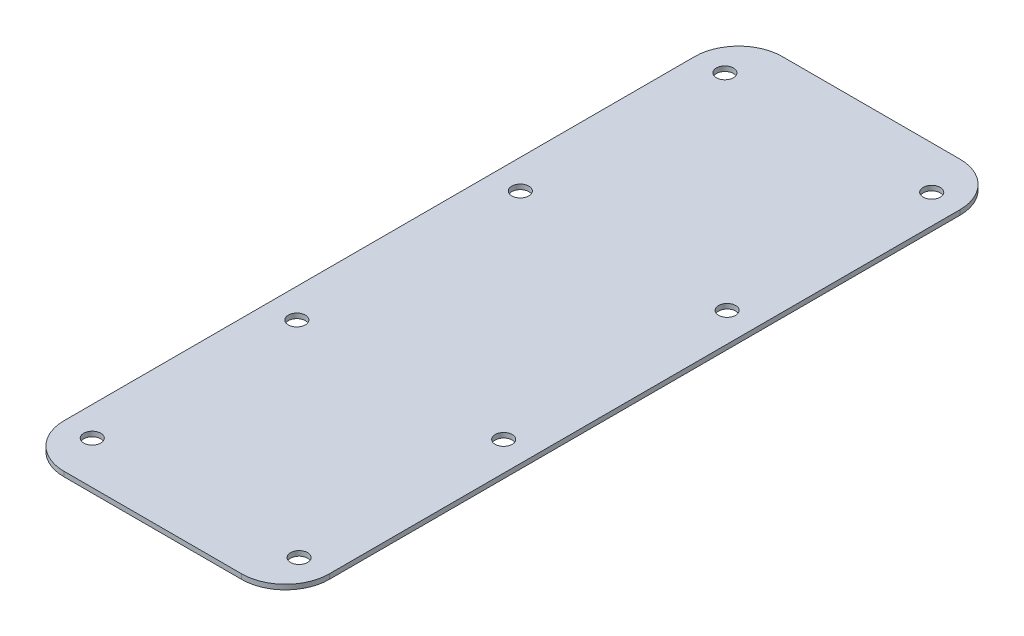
ISO-10303-21;
HEADER;
FILE_DESCRIPTION(('STEP AP214'),'2;1');
FILE_NAME('part.step','',(''),(''),'','','');
FILE_SCHEMA(('AUTOMOTIVE_DESIGN { 1 0 10303 214 1 1 1 1 }'));
ENDSEC;
DATA;
#1=APPLICATION_CONTEXT('core data for automotive mechanical design processes');
#2=APPLICATION_PROTOCOL_DEFINITION('international standard','automotive_design',2000,#1);
#3=PRODUCT_CONTEXT('',#1,'mechanical');
#4=PRODUCT('Part','Part','',(#3));
#5=PRODUCT_RELATED_PRODUCT_CATEGORY('part','',(#4));
#6=PRODUCT_DEFINITION_FORMATION('','',#4);
#7=PRODUCT_DEFINITION_CONTEXT('part definition',#1,'design');
#8=PRODUCT_DEFINITION('design','',#6,#7);
#9=PRODUCT_DEFINITION_SHAPE('','',#8);
#10=(LENGTH_UNIT() NAMED_UNIT(*) SI_UNIT(.MILLI.,.METRE.));
#11=(NAMED_UNIT(*) PLANE_ANGLE_UNIT() SI_UNIT($,.RADIAN.));
#12=(NAMED_UNIT(*) SI_UNIT($,.STERADIAN.) SOLID_ANGLE_UNIT());
#13=UNCERTAINTY_MEASURE_WITH_UNIT(LENGTH_MEASURE(1.E-05),#10,'distance_accuracy_value','');
#14=(GEOMETRIC_REPRESENTATION_CONTEXT(3) GLOBAL_UNCERTAINTY_ASSIGNED_CONTEXT((#13)) GLOBAL_UNIT_ASSIGNED_CONTEXT((#10,
#11,#12)) REPRESENTATION_CONTEXT('',''));
#15=CARTESIAN_POINT('',(0.,0.,0.));
#16=DIRECTION('',(0.,0.,1.));
#17=DIRECTION('',(1.,0.,0.));
#18=AXIS2_PLACEMENT_3D('',#15,#16,#17);
#19=CARTESIAN_POINT('',(0.,12.7,0.));
#20=DIRECTION('',(0.,1.,0.));
#21=DIRECTION('',(0.,0.,1.));
#22=AXIS2_PLACEMENT_3D('',#19,#20,#21);
#23=PLANE('',#22);
#24=CARTESIAN_POINT('',(-231.822207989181,12.7,264.461207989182));
#25=DIRECTION('',(0.,1.,0.));
#26=DIRECTION('',(0.,0.,1.));
#27=AXIS2_PLACEMENT_3D('',#24,#25,#26);
#28=CIRCLE('',#27,114.3);
#29=CARTESIAN_POINT('',(-346.122207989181,12.7,264.461207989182));
#30=VERTEX_POINT('',#29);
#31=CARTESIAN_POINT('',(-231.822207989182,12.7,378.761207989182));
#32=VERTEX_POINT('',#31);
#33=EDGE_CURVE('E50',#30,#32,#28,.T.);
#34=ORIENTED_EDGE('',*,*,#33,.T.);
#35=DIRECTION('',(1.,0.,0.));
#36=VECTOR('',#35,1.);
#37=CARTESIAN_POINT('',(-231.822207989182,12.7,378.761207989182));
#38=LINE('',#37,#36);
#39=CARTESIAN_POINT('',(231.822207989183,12.7,378.761207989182));
#40=VERTEX_POINT('',#39);
#41=EDGE_CURVE('E105',#32,#40,#38,.T.);
#42=ORIENTED_EDGE('',*,*,#41,.T.);
#43=CARTESIAN_POINT('',(231.822207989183,12.7,264.461207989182));
#44=DIRECTION('',(0.,1.,0.));
#45=DIRECTION('',(0.,0.,1.));
#46=AXIS2_PLACEMENT_3D('',#43,#44,#45);
#47=CIRCLE('',#46,114.3);
#48=CARTESIAN_POINT('',(346.122207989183,12.7,264.461207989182));
#49=VERTEX_POINT('',#48);
#50=EDGE_CURVE('E110',#40,#49,#47,.T.);
#51=ORIENTED_EDGE('',*,*,#50,.T.);
#52=DIRECTION('',(0.,0.,-1.));
#53=VECTOR('',#52,1.);
#54=CARTESIAN_POINT('',(346.122207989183,12.7,-1381.63787465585));
#55=LINE('',#54,#53);
#56=CARTESIAN_POINT('',(346.122207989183,12.7,-1381.63787465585));
#57=VERTEX_POINT('',#56);
#58=EDGE_CURVE('E126',#49,#57,#55,.T.);
#59=ORIENTED_EDGE('',*,*,#58,.T.);
#60=CARTESIAN_POINT('',(231.822207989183,12.7,-1381.63787465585));
#61=DIRECTION('',(0.,1.,0.));
#62=DIRECTION('',(0.,0.,-1.));
#63=AXIS2_PLACEMENT_3D('',#60,#61,#62);
#64=CIRCLE('',#63,114.3);
#65=CARTESIAN_POINT('',(231.822207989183,12.7,-1495.93787465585));
#66=VERTEX_POINT('',#65);
#67=EDGE_CURVE('E129',#57,#66,#64,.T.);
#68=ORIENTED_EDGE('',*,*,#67,.T.);
#69=DIRECTION('',(-1.,0.,0.));
#70=VECTOR('',#69,1.);
#71=CARTESIAN_POINT('',(-231.822207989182,12.7,-1495.93787465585));
#72=LINE('',#71,#70);
#73=CARTESIAN_POINT('',(-231.822207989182,12.7,-1495.93787465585));
#74=VERTEX_POINT('',#73);
#75=EDGE_CURVE('E132',#66,#74,#72,.T.);
#76=ORIENTED_EDGE('',*,*,#75,.T.);
#77=CARTESIAN_POINT('',(-231.822207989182,12.7,-1381.63787465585));
#78=DIRECTION('',(0.,1.,0.));
#79=DIRECTION('',(0.,0.,1.));
#80=AXIS2_PLACEMENT_3D('',#77,#78,#79);
#81=CIRCLE('',#80,114.3);
#82=CARTESIAN_POINT('',(-346.122207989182,12.7,-1381.63787465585));
#83=VERTEX_POINT('',#82);
#84=EDGE_CURVE('E135',#74,#83,#81,.T.);
#85=ORIENTED_EDGE('',*,*,#84,.T.);
#86=DIRECTION('',(0.,0.,1.));
#87=VECTOR('',#86,1.);
#88=CARTESIAN_POINT('',(-346.122207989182,12.7,-1381.63787465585));
#89=LINE('',#88,#87);
#90=EDGE_CURVE('E116',#83,#30,#89,.T.);
#91=ORIENTED_EDGE('',*,*,#90,.T.);
#92=EDGE_LOOP('',(#34,#42,#51,#59,#68,#76,#85,#91));
#93=FACE_BOUND('',#92,.T.);
#94=CARTESIAN_POINT('',(-269.922207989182,12.7,267.001207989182));
#95=DIRECTION('',(0.,1.,0.));
#96=DIRECTION('',(0.,0.,1.));
#97=AXIS2_PLACEMENT_3D('',#94,#95,#96);
#98=CIRCLE('',#97,22.225);
#99=CARTESIAN_POINT('',(-269.922207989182,12.7,289.226207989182));
#100=VERTEX_POINT('',#99);
#101=EDGE_CURVE('E122',#100,#100,#98,.T.);
#102=ORIENTED_EDGE('',*,*,#101,.F.);
#103=EDGE_LOOP('',(#102));
#104=FACE_BOUND('',#103,.T.);
#105=CARTESIAN_POINT('',(-269.922207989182,12.7,-267.001207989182));
#106=DIRECTION('',(0.,1.,0.));
#107=DIRECTION('',(0.,0.,1.));
#108=AXIS2_PLACEMENT_3D('',#105,#106,#107);
#109=CIRCLE('',#108,22.225);
#110=CARTESIAN_POINT('',(-269.922207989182,12.7,-244.776207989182));
#111=VERTEX_POINT('',#110);
#112=EDGE_CURVE('E359',#111,#111,#109,.T.);
#113=ORIENTED_EDGE('',*,*,#112,.F.);
#114=EDGE_LOOP('',(#113));
#115=FACE_BOUND('',#114,.T.);
#116=CARTESIAN_POINT('',(-269.922207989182,12.7,-850.175458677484));
#117=DIRECTION('',(0.,1.,0.));
#118=DIRECTION('',(0.,0.,1.));
#119=AXIS2_PLACEMENT_3D('',#116,#117,#118);
#120=CIRCLE('',#119,22.225);
#121=CARTESIAN_POINT('',(-269.922207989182,12.7,-827.950458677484));
#122=VERTEX_POINT('',#121);
#123=EDGE_CURVE('E353',#122,#122,#120,.T.);
#124=ORIENTED_EDGE('',*,*,#123,.F.);
#125=EDGE_LOOP('',(#124));
#126=FACE_BOUND('',#125,.T.);
#127=CARTESIAN_POINT('',(-269.922207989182,12.7,-1384.17787465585));
#128=DIRECTION('',(0.,1.,0.));
#129=DIRECTION('',(0.,0.,1.));
#130=AXIS2_PLACEMENT_3D('',#127,#128,#129);
#131=CIRCLE('',#130,22.2249999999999);
#132=CARTESIAN_POINT('',(-269.922207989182,12.7,-1361.95287465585));
#133=VERTEX_POINT('',#132);
#134=EDGE_CURVE('E347',#133,#133,#131,.T.);
#135=ORIENTED_EDGE('',*,*,#134,.F.);
#136=EDGE_LOOP('',(#135));
#137=FACE_BOUND('',#136,.T.);
#138=CARTESIAN_POINT('',(269.922207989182,12.7,-1384.17787465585));
#139=DIRECTION('',(0.,1.,0.));
#140=DIRECTION('',(0.,0.,1.));
#141=AXIS2_PLACEMENT_3D('',#138,#139,#140);
#142=CIRCLE('',#141,22.225);
#143=CARTESIAN_POINT('',(269.922207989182,12.7,-1361.95287465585));
#144=VERTEX_POINT('',#143);
#145=EDGE_CURVE('E341',#144,#144,#142,.T.);
#146=ORIENTED_EDGE('',*,*,#145,.F.);
#147=EDGE_LOOP('',(#146));
#148=FACE_BOUND('',#147,.T.);
#149=CARTESIAN_POINT('',(269.922207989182,12.7,-850.175458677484));
#150=DIRECTION('',(0.,1.,0.));
#151=DIRECTION('',(0.,0.,1.));
#152=AXIS2_PLACEMENT_3D('',#149,#150,#151);
#153=CIRCLE('',#152,22.225);
#154=CARTESIAN_POINT('',(269.922207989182,12.7,-827.950458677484));
#155=VERTEX_POINT('',#154);
#156=EDGE_CURVE('E335',#155,#155,#153,.T.);
#157=ORIENTED_EDGE('',*,*,#156,.F.);
#158=EDGE_LOOP('',(#157));
#159=FACE_BOUND('',#158,.T.);
#160=CARTESIAN_POINT('',(269.922207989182,12.7,-267.001207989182));
#161=DIRECTION('',(0.,1.,0.));
#162=DIRECTION('',(0.,0.,1.));
#163=AXIS2_PLACEMENT_3D('',#160,#161,#162);
#164=CIRCLE('',#163,22.225);
#165=CARTESIAN_POINT('',(269.922207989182,12.7,-244.776207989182));
#166=VERTEX_POINT('',#165);
#167=EDGE_CURVE('E329',#166,#166,#164,.T.);
#168=ORIENTED_EDGE('',*,*,#167,.F.);
#169=EDGE_LOOP('',(#168));
#170=FACE_BOUND('',#169,.T.);
#171=CARTESIAN_POINT('',(269.922207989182,12.7,267.001207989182));
#172=DIRECTION('',(0.,1.,0.));
#173=DIRECTION('',(0.,0.,1.));
#174=AXIS2_PLACEMENT_3D('',#171,#172,#173);
#175=CIRCLE('',#174,22.225);
#176=CARTESIAN_POINT('',(269.922207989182,12.7,289.226207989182));
#177=VERTEX_POINT('',#176);
#178=EDGE_CURVE('E326',#177,#177,#175,.T.);
#179=ORIENTED_EDGE('',*,*,#178,.F.);
#180=EDGE_LOOP('',(#179));
#181=FACE_BOUND('',#180,.T.);
#182=ADVANCED_FACE('F35',(#93,#104,#115,#126,#137,#148,#159,#170,#181),#23,.T.);
#183=CARTESIAN_POINT('',(0.,0.,0.));
#184=DIRECTION('',(0.,1.,0.));
#185=DIRECTION('',(0.,0.,1.));
#186=AXIS2_PLACEMENT_3D('',#183,#184,#185);
#187=PLANE('',#186);
#188=DIRECTION('',(1.,0.,0.));
#189=VECTOR('',#188,1.);
#190=CARTESIAN_POINT('',(-231.822207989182,0.,378.761207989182));
#191=LINE('',#190,#189);
#192=CARTESIAN_POINT('',(-231.822207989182,0.,378.761207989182));
#193=VERTEX_POINT('',#192);
#194=CARTESIAN_POINT('',(231.822207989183,0.,378.761207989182));
#195=VERTEX_POINT('',#194);
#196=EDGE_CURVE('E140',#193,#195,#191,.T.);
#197=ORIENTED_EDGE('',*,*,#196,.F.);
#198=CARTESIAN_POINT('',(-231.822207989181,0.,264.461207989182));
#199=DIRECTION('',(0.,1.,0.));
#200=DIRECTION('',(0.,0.,1.));
#201=AXIS2_PLACEMENT_3D('',#198,#199,#200);
#202=CIRCLE('',#201,114.3);
#203=CARTESIAN_POINT('',(-346.122207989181,0.,264.461207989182));
#204=VERTEX_POINT('',#203);
#205=EDGE_CURVE('E100',#204,#193,#202,.T.);
#206=ORIENTED_EDGE('',*,*,#205,.F.);
#207=DIRECTION('',(0.,0.,1.));
#208=VECTOR('',#207,1.);
#209=CARTESIAN_POINT('',(-346.122207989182,0.,-1381.63787465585));
#210=LINE('',#209,#208);
#211=CARTESIAN_POINT('',(-346.122207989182,0.,-1381.63787465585));
#212=VERTEX_POINT('',#211);
#213=EDGE_CURVE('E117',#212,#204,#210,.T.);
#214=ORIENTED_EDGE('',*,*,#213,.F.);
#215=CARTESIAN_POINT('',(-231.822207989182,0.,-1381.63787465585));
#216=DIRECTION('',(0.,1.,0.));
#217=DIRECTION('',(0.,0.,1.));
#218=AXIS2_PLACEMENT_3D('',#215,#216,#217);
#219=CIRCLE('',#218,114.3);
#220=CARTESIAN_POINT('',(-231.822207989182,0.,-1495.93787465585));
#221=VERTEX_POINT('',#220);
#222=EDGE_CURVE('E58',#221,#212,#219,.T.);
#223=ORIENTED_EDGE('',*,*,#222,.F.);
#224=DIRECTION('',(-1.,0.,0.));
#225=VECTOR('',#224,1.);
#226=CARTESIAN_POINT('',(-231.822207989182,0.,-1495.93787465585));
#227=LINE('',#226,#225);
#228=CARTESIAN_POINT('',(231.822207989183,0.,-1495.93787465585));
#229=VERTEX_POINT('',#228);
#230=EDGE_CURVE('E152',#229,#221,#227,.T.);
#231=ORIENTED_EDGE('',*,*,#230,.F.);
#232=CARTESIAN_POINT('',(231.822207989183,0.,-1381.63787465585));
#233=DIRECTION('',(0.,1.,0.));
#234=DIRECTION('',(0.,0.,-1.));
#235=AXIS2_PLACEMENT_3D('',#232,#233,#234);
#236=CIRCLE('',#235,114.3);
#237=CARTESIAN_POINT('',(346.122207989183,0.,-1381.63787465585));
#238=VERTEX_POINT('',#237);
#239=EDGE_CURVE('E149',#238,#229,#236,.T.);
#240=ORIENTED_EDGE('',*,*,#239,.F.);
#241=DIRECTION('',(0.,0.,-1.));
#242=VECTOR('',#241,1.);
#243=CARTESIAN_POINT('',(346.122207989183,0.,-1381.63787465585));
#244=LINE('',#243,#242);
#245=CARTESIAN_POINT('',(346.122207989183,0.,264.461207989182));
#246=VERTEX_POINT('',#245);
#247=EDGE_CURVE('E146',#246,#238,#244,.T.);
#248=ORIENTED_EDGE('',*,*,#247,.F.);
#249=CARTESIAN_POINT('',(231.822207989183,0.,264.461207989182));
#250=DIRECTION('',(0.,1.,0.));
#251=DIRECTION('',(0.,0.,1.));
#252=AXIS2_PLACEMENT_3D('',#249,#250,#251);
#253=CIRCLE('',#252,114.3);
#254=EDGE_CURVE('E143',#195,#246,#253,.T.);
#255=ORIENTED_EDGE('',*,*,#254,.F.);
#256=EDGE_LOOP('',(#197,#206,#214,#223,#231,#240,#248,#255));
#257=FACE_BOUND('',#256,.T.);
#258=CARTESIAN_POINT('',(-269.922207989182,0.,267.001207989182));
#259=DIRECTION('',(0.,1.,0.));
#260=DIRECTION('',(0.,0.,1.));
#261=AXIS2_PLACEMENT_3D('',#258,#259,#260);
#262=CIRCLE('',#261,22.225);
#263=CARTESIAN_POINT('',(-269.922207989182,0.,289.226207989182));
#264=VERTEX_POINT('',#263);
#265=EDGE_CURVE('E141',#264,#264,#262,.T.);
#266=ORIENTED_EDGE('',*,*,#265,.T.);
#267=EDGE_LOOP('',(#266));
#268=FACE_BOUND('',#267,.T.);
#269=CARTESIAN_POINT('',(-269.922207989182,0.,-267.001207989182));
#270=DIRECTION('',(0.,1.,0.));
#271=DIRECTION('',(0.,0.,1.));
#272=AXIS2_PLACEMENT_3D('',#269,#270,#271);
#273=CIRCLE('',#272,22.225);
#274=CARTESIAN_POINT('',(-269.922207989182,0.,-244.776207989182));
#275=VERTEX_POINT('',#274);
#276=EDGE_CURVE('E362',#275,#275,#273,.T.);
#277=ORIENTED_EDGE('',*,*,#276,.T.);
#278=EDGE_LOOP('',(#277));
#279=FACE_BOUND('',#278,.T.);
#280=CARTESIAN_POINT('',(-269.922207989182,0.,-850.175458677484));
#281=DIRECTION('',(0.,1.,0.));
#282=DIRECTION('',(0.,0.,1.));
#283=AXIS2_PLACEMENT_3D('',#280,#281,#282);
#284=CIRCLE('',#283,22.225);
#285=CARTESIAN_POINT('',(-269.922207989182,0.,-827.950458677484));
#286=VERTEX_POINT('',#285);
#287=EDGE_CURVE('E356',#286,#286,#284,.T.);
#288=ORIENTED_EDGE('',*,*,#287,.T.);
#289=EDGE_LOOP('',(#288));
#290=FACE_BOUND('',#289,.T.);
#291=CARTESIAN_POINT('',(-269.922207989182,0.,-1384.17787465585));
#292=DIRECTION('',(0.,1.,0.));
#293=DIRECTION('',(0.,0.,1.));
#294=AXIS2_PLACEMENT_3D('',#291,#292,#293);
#295=CIRCLE('',#294,22.2249999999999);
#296=CARTESIAN_POINT('',(-269.922207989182,0.,-1361.95287465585));
#297=VERTEX_POINT('',#296);
#298=EDGE_CURVE('E350',#297,#297,#295,.T.);
#299=ORIENTED_EDGE('',*,*,#298,.T.);
#300=EDGE_LOOP('',(#299));
#301=FACE_BOUND('',#300,.T.);
#302=CARTESIAN_POINT('',(269.922207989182,0.,-1384.17787465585));
#303=DIRECTION('',(0.,1.,0.));
#304=DIRECTION('',(0.,0.,1.));
#305=AXIS2_PLACEMENT_3D('',#302,#303,#304);
#306=CIRCLE('',#305,22.225);
#307=CARTESIAN_POINT('',(269.922207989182,0.,-1361.95287465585));
#308=VERTEX_POINT('',#307);
#309=EDGE_CURVE('E344',#308,#308,#306,.T.);
#310=ORIENTED_EDGE('',*,*,#309,.T.);
#311=EDGE_LOOP('',(#310));
#312=FACE_BOUND('',#311,.T.);
#313=CARTESIAN_POINT('',(269.922207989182,0.,-850.175458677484));
#314=DIRECTION('',(0.,1.,0.));
#315=DIRECTION('',(0.,0.,1.));
#316=AXIS2_PLACEMENT_3D('',#313,#314,#315);
#317=CIRCLE('',#316,22.225);
#318=CARTESIAN_POINT('',(269.922207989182,0.,-827.950458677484));
#319=VERTEX_POINT('',#318);
#320=EDGE_CURVE('E338',#319,#319,#317,.T.);
#321=ORIENTED_EDGE('',*,*,#320,.T.);
#322=EDGE_LOOP('',(#321));
#323=FACE_BOUND('',#322,.T.);
#324=CARTESIAN_POINT('',(269.922207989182,0.,-267.001207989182));
#325=DIRECTION('',(0.,1.,0.));
#326=DIRECTION('',(0.,0.,1.));
#327=AXIS2_PLACEMENT_3D('',#324,#325,#326);
#328=CIRCLE('',#327,22.225);
#329=CARTESIAN_POINT('',(269.922207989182,0.,-244.776207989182));
#330=VERTEX_POINT('',#329);
#331=EDGE_CURVE('E332',#330,#330,#328,.T.);
#332=ORIENTED_EDGE('',*,*,#331,.T.);
#333=EDGE_LOOP('',(#332));
#334=FACE_BOUND('',#333,.T.);
#335=CARTESIAN_POINT('',(269.922207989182,0.,267.001207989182));
#336=DIRECTION('',(0.,1.,0.));
#337=DIRECTION('',(0.,0.,1.));
#338=AXIS2_PLACEMENT_3D('',#335,#336,#337);
#339=CIRCLE('',#338,22.225);
#340=CARTESIAN_POINT('',(269.922207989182,0.,289.226207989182));
#341=VERTEX_POINT('',#340);
#342=EDGE_CURVE('E323',#341,#341,#339,.T.);
#343=ORIENTED_EDGE('',*,*,#342,.T.);
#344=EDGE_LOOP('',(#343));
#345=FACE_BOUND('',#344,.T.);
#346=ADVANCED_FACE('F37',(#257,#268,#279,#290,#301,#312,#323,#334,#345),#187,.F.);
#347=CARTESIAN_POINT('',(-231.822207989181,12.7,264.461207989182));
#348=DIRECTION('',(0.,-1.,0.));
#349=DIRECTION('',(0.,0.,-1.));
#350=AXIS2_PLACEMENT_3D('',#347,#348,#349);
#351=CYLINDRICAL_SURFACE('',#350,114.3);
#352=ORIENTED_EDGE('',*,*,#205,.T.);
#353=DIRECTION('',(0.,-1.,0.));
#354=VECTOR('',#353,1.);
#355=CARTESIAN_POINT('',(-231.822207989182,12.7,378.761207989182));
#356=LINE('',#355,#354);
#357=EDGE_CURVE('E11',#32,#193,#356,.T.);
#358=ORIENTED_EDGE('',*,*,#357,.F.);
#359=ORIENTED_EDGE('',*,*,#33,.F.);
#360=DIRECTION('',(0.,-1.,0.));
#361=VECTOR('',#360,1.);
#362=CARTESIAN_POINT('',(-346.122207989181,12.7,264.461207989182));
#363=LINE('',#362,#361);
#364=EDGE_CURVE('E138',#30,#204,#363,.T.);
#365=ORIENTED_EDGE('',*,*,#364,.T.);
#366=EDGE_LOOP('',(#352,#358,#359,#365));
#367=FACE_BOUND('',#366,.T.);
#368=ADVANCED_FACE('F98',(#367),#351,.T.);
#369=CARTESIAN_POINT('',(-231.822207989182,12.7,378.761207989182));
#370=DIRECTION('',(0.,0.,-1.));
#371=DIRECTION('',(-1.,0.,0.));
#372=AXIS2_PLACEMENT_3D('',#369,#370,#371);
#373=PLANE('',#372);
#374=ORIENTED_EDGE('',*,*,#196,.T.);
#375=DIRECTION('',(0.,-1.,0.));
#376=VECTOR('',#375,1.);
#377=CARTESIAN_POINT('',(231.822207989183,12.7,378.761207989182));
#378=LINE('',#377,#376);
#379=EDGE_CURVE('E43',#40,#195,#378,.T.);
#380=ORIENTED_EDGE('',*,*,#379,.F.);
#381=ORIENTED_EDGE('',*,*,#41,.F.);
#382=ORIENTED_EDGE('',*,*,#357,.T.);
#383=EDGE_LOOP('',(#374,#380,#381,#382));
#384=FACE_BOUND('',#383,.T.);
#385=ADVANCED_FACE('F106',(#384),#373,.F.);
#386=CARTESIAN_POINT('',(231.822207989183,12.7,264.461207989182));
#387=DIRECTION('',(0.,-1.,0.));
#388=DIRECTION('',(0.,0.,-1.));
#389=AXIS2_PLACEMENT_3D('',#386,#387,#388);
#390=CYLINDRICAL_SURFACE('',#389,114.3);
#391=ORIENTED_EDGE('',*,*,#254,.T.);
#392=DIRECTION('',(0.,-1.,0.));
#393=VECTOR('',#392,1.);
#394=CARTESIAN_POINT('',(346.122207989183,12.7,264.461207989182));
#395=LINE('',#394,#393);
#396=EDGE_CURVE('E165',#49,#246,#395,.T.);
#397=ORIENTED_EDGE('',*,*,#396,.F.);
#398=ORIENTED_EDGE('',*,*,#50,.F.);
#399=ORIENTED_EDGE('',*,*,#379,.T.);
#400=EDGE_LOOP('',(#391,#397,#398,#399));
#401=FACE_BOUND('',#400,.T.);
#402=ADVANCED_FACE('F167',(#401),#390,.T.);
#403=CARTESIAN_POINT('',(346.122207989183,12.7,-1381.63787465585));
#404=DIRECTION('',(-1.,0.,0.));
#405=DIRECTION('',(0.,0.,1.));
#406=AXIS2_PLACEMENT_3D('',#403,#404,#405);
#407=PLANE('',#406);
#408=ORIENTED_EDGE('',*,*,#247,.T.);
#409=DIRECTION('',(0.,-1.,0.));
#410=VECTOR('',#409,1.);
#411=CARTESIAN_POINT('',(346.122207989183,12.7,-1381.63787465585));
#412=LINE('',#411,#410);
#413=EDGE_CURVE('E163',#57,#238,#412,.T.);
#414=ORIENTED_EDGE('',*,*,#413,.F.);
#415=ORIENTED_EDGE('',*,*,#58,.F.);
#416=ORIENTED_EDGE('',*,*,#396,.T.);
#417=EDGE_LOOP('',(#408,#414,#415,#416));
#418=FACE_BOUND('',#417,.T.);
#419=ADVANCED_FACE('F175',(#418),#407,.F.);
#420=CARTESIAN_POINT('',(231.822207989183,12.7,-1381.63787465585));
#421=DIRECTION('',(0.,-1.,0.));
#422=DIRECTION('',(0.,0.,-1.));
#423=AXIS2_PLACEMENT_3D('',#420,#421,#422);
#424=CYLINDRICAL_SURFACE('',#423,114.3);
#425=ORIENTED_EDGE('',*,*,#239,.T.);
#426=DIRECTION('',(0.,-1.,0.));
#427=VECTOR('',#426,1.);
#428=CARTESIAN_POINT('',(231.822207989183,12.7,-1495.93787465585));
#429=LINE('',#428,#427);
#430=EDGE_CURVE('E161',#66,#229,#429,.T.);
#431=ORIENTED_EDGE('',*,*,#430,.F.);
#432=ORIENTED_EDGE('',*,*,#67,.F.);
#433=ORIENTED_EDGE('',*,*,#413,.T.);
#434=EDGE_LOOP('',(#425,#431,#432,#433));
#435=FACE_BOUND('',#434,.T.);
#436=ADVANCED_FACE('F180',(#435),#424,.T.);
#437=CARTESIAN_POINT('',(-231.822207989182,12.7,-1495.93787465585));
#438=DIRECTION('',(0.,0.,1.));
#439=DIRECTION('',(1.,0.,0.));
#440=AXIS2_PLACEMENT_3D('',#437,#438,#439);
#441=PLANE('',#440);
#442=ORIENTED_EDGE('',*,*,#230,.T.);
#443=DIRECTION('',(0.,-1.,0.));
#444=VECTOR('',#443,1.);
#445=CARTESIAN_POINT('',(-231.822207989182,12.7,-1495.93787465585));
#446=LINE('',#445,#444);
#447=EDGE_CURVE('E159',#74,#221,#446,.T.);
#448=ORIENTED_EDGE('',*,*,#447,.F.);
#449=ORIENTED_EDGE('',*,*,#75,.F.);
#450=ORIENTED_EDGE('',*,*,#430,.T.);
#451=EDGE_LOOP('',(#442,#448,#449,#450));
#452=FACE_BOUND('',#451,.T.);
#453=ADVANCED_FACE('F182',(#452),#441,.F.);
#454=CARTESIAN_POINT('',(-231.822207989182,12.7,-1381.63787465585));
#455=DIRECTION('',(0.,-1.,0.));
#456=DIRECTION('',(0.,0.,-1.));
#457=AXIS2_PLACEMENT_3D('',#454,#455,#456);
#458=CYLINDRICAL_SURFACE('',#457,114.3);
#459=ORIENTED_EDGE('',*,*,#222,.T.);
#460=DIRECTION('',(0.,-1.,0.));
#461=VECTOR('',#460,1.);
#462=CARTESIAN_POINT('',(-346.122207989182,12.7,-1381.63787465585));
#463=LINE('',#462,#461);
#464=EDGE_CURVE('E157',#83,#212,#463,.T.);
#465=ORIENTED_EDGE('',*,*,#464,.F.);
#466=ORIENTED_EDGE('',*,*,#84,.F.);
#467=ORIENTED_EDGE('',*,*,#447,.T.);
#468=EDGE_LOOP('',(#459,#465,#466,#467));
#469=FACE_BOUND('',#468,.T.);
#470=ADVANCED_FACE('F184',(#469),#458,.T.);
#471=CARTESIAN_POINT('',(-346.122207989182,12.7,-1381.63787465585));
#472=DIRECTION('',(1.,0.,0.));
#473=DIRECTION('',(0.,0.,-1.));
#474=AXIS2_PLACEMENT_3D('',#471,#472,#473);
#475=PLANE('',#474);
#476=ORIENTED_EDGE('',*,*,#213,.T.);
#477=ORIENTED_EDGE('',*,*,#364,.F.);
#478=ORIENTED_EDGE('',*,*,#90,.F.);
#479=ORIENTED_EDGE('',*,*,#464,.T.);
#480=EDGE_LOOP('',(#476,#477,#478,#479));
#481=FACE_BOUND('',#480,.T.);
#482=ADVANCED_FACE('F187',(#481),#475,.F.);
#483=CARTESIAN_POINT('',(-269.922207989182,102.502561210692,267.001207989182));
#484=DIRECTION('',(0.,-1.,0.));
#485=DIRECTION('',(0.,0.,-1.));
#486=AXIS2_PLACEMENT_3D('',#483,#484,#485);
#487=CYLINDRICAL_SURFACE('',#486,22.225);
#488=ORIENTED_EDGE('',*,*,#265,.F.);
#489=EDGE_LOOP('',(#488));
#490=FACE_BOUND('',#489,.T.);
#491=ORIENTED_EDGE('',*,*,#101,.T.);
#492=EDGE_LOOP('',(#491));
#493=FACE_BOUND('',#492,.T.);
#494=ADVANCED_FACE('F189',(#490,#493),#487,.F.);
#495=CARTESIAN_POINT('',(-269.922207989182,102.502561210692,-267.001207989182));
#496=DIRECTION('',(0.,-1.,0.));
#497=DIRECTION('',(0.,0.,-1.));
#498=AXIS2_PLACEMENT_3D('',#495,#496,#497);
#499=CYLINDRICAL_SURFACE('',#498,22.225);
#500=ORIENTED_EDGE('',*,*,#276,.F.);
#501=EDGE_LOOP('',(#500));
#502=FACE_BOUND('',#501,.T.);
#503=ORIENTED_EDGE('',*,*,#112,.T.);
#504=EDGE_LOOP('',(#503));
#505=FACE_BOUND('',#504,.T.);
#506=ADVANCED_FACE('F195',(#502,#505),#499,.F.);
#507=CARTESIAN_POINT('',(-269.922207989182,102.502561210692,-850.175458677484));
#508=DIRECTION('',(0.,-1.,0.));
#509=DIRECTION('',(0.,0.,-1.));
#510=AXIS2_PLACEMENT_3D('',#507,#508,#509);
#511=CYLINDRICAL_SURFACE('',#510,22.225);
#512=ORIENTED_EDGE('',*,*,#287,.F.);
#513=EDGE_LOOP('',(#512));
#514=FACE_BOUND('',#513,.T.);
#515=ORIENTED_EDGE('',*,*,#123,.T.);
#516=EDGE_LOOP('',(#515));
#517=FACE_BOUND('',#516,.T.);
#518=ADVANCED_FACE('F256',(#514,#517),#511,.F.);
#519=CARTESIAN_POINT('',(-269.922207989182,102.502561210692,-1384.17787465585));
#520=DIRECTION('',(0.,-1.,0.));
#521=DIRECTION('',(0.,0.,-1.));
#522=AXIS2_PLACEMENT_3D('',#519,#520,#521);
#523=CYLINDRICAL_SURFACE('',#522,22.2249999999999);
#524=ORIENTED_EDGE('',*,*,#298,.F.);
#525=EDGE_LOOP('',(#524));
#526=FACE_BOUND('',#525,.T.);
#527=ORIENTED_EDGE('',*,*,#134,.T.);
#528=EDGE_LOOP('',(#527));
#529=FACE_BOUND('',#528,.T.);
#530=ADVANCED_FACE('F266',(#526,#529),#523,.F.);
#531=CARTESIAN_POINT('',(269.922207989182,102.502561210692,-1384.17787465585));
#532=DIRECTION('',(0.,-1.,0.));
#533=DIRECTION('',(0.,0.,-1.));
#534=AXIS2_PLACEMENT_3D('',#531,#532,#533);
#535=CYLINDRICAL_SURFACE('',#534,22.225);
#536=ORIENTED_EDGE('',*,*,#309,.F.);
#537=EDGE_LOOP('',(#536));
#538=FACE_BOUND('',#537,.T.);
#539=ORIENTED_EDGE('',*,*,#145,.T.);
#540=EDGE_LOOP('',(#539));
#541=FACE_BOUND('',#540,.T.);
#542=ADVANCED_FACE('F276',(#538,#541),#535,.F.);
#543=CARTESIAN_POINT('',(269.922207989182,102.502561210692,-850.175458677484));
#544=DIRECTION('',(0.,-1.,0.));
#545=DIRECTION('',(0.,0.,-1.));
#546=AXIS2_PLACEMENT_3D('',#543,#544,#545);
#547=CYLINDRICAL_SURFACE('',#546,22.225);
#548=ORIENTED_EDGE('',*,*,#320,.F.);
#549=EDGE_LOOP('',(#548));
#550=FACE_BOUND('',#549,.T.);
#551=ORIENTED_EDGE('',*,*,#156,.T.);
#552=EDGE_LOOP('',(#551));
#553=FACE_BOUND('',#552,.T.);
#554=ADVANCED_FACE('F286',(#550,#553),#547,.F.);
#555=CARTESIAN_POINT('',(269.922207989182,102.502561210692,-267.001207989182));
#556=DIRECTION('',(0.,-1.,0.));
#557=DIRECTION('',(0.,0.,-1.));
#558=AXIS2_PLACEMENT_3D('',#555,#556,#557);
#559=CYLINDRICAL_SURFACE('',#558,22.225);
#560=ORIENTED_EDGE('',*,*,#331,.F.);
#561=EDGE_LOOP('',(#560));
#562=FACE_BOUND('',#561,.T.);
#563=ORIENTED_EDGE('',*,*,#167,.T.);
#564=EDGE_LOOP('',(#563));
#565=FACE_BOUND('',#564,.T.);
#566=ADVANCED_FACE('F296',(#562,#565),#559,.F.);
#567=CARTESIAN_POINT('',(269.922207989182,102.502561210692,267.001207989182));
#568=DIRECTION('',(0.,-1.,0.));
#569=DIRECTION('',(0.,0.,-1.));
#570=AXIS2_PLACEMENT_3D('',#567,#568,#569);
#571=CYLINDRICAL_SURFACE('',#570,22.225);
#572=ORIENTED_EDGE('',*,*,#342,.F.);
#573=EDGE_LOOP('',(#572));
#574=FACE_BOUND('',#573,.T.);
#575=ORIENTED_EDGE('',*,*,#178,.T.);
#576=EDGE_LOOP('',(#575));
#577=FACE_BOUND('',#576,.T.);
#578=ADVANCED_FACE('F306',(#574,#577),#571,.F.);
#579=CLOSED_SHELL('',(#182,#346,#368,#385,#402,#419,#436,#453,#470,#482,#494,#506,#518,#530,
#542,#554,#566,#578));
#580=MANIFOLD_SOLID_BREP('B2',#579);
#581=ADVANCED_BREP_SHAPE_REPRESENTATION('',(#18,#580),#14);
#582=SHAPE_DEFINITION_REPRESENTATION(#9,#581);
ENDSEC;
END-ISO-10303-21;
